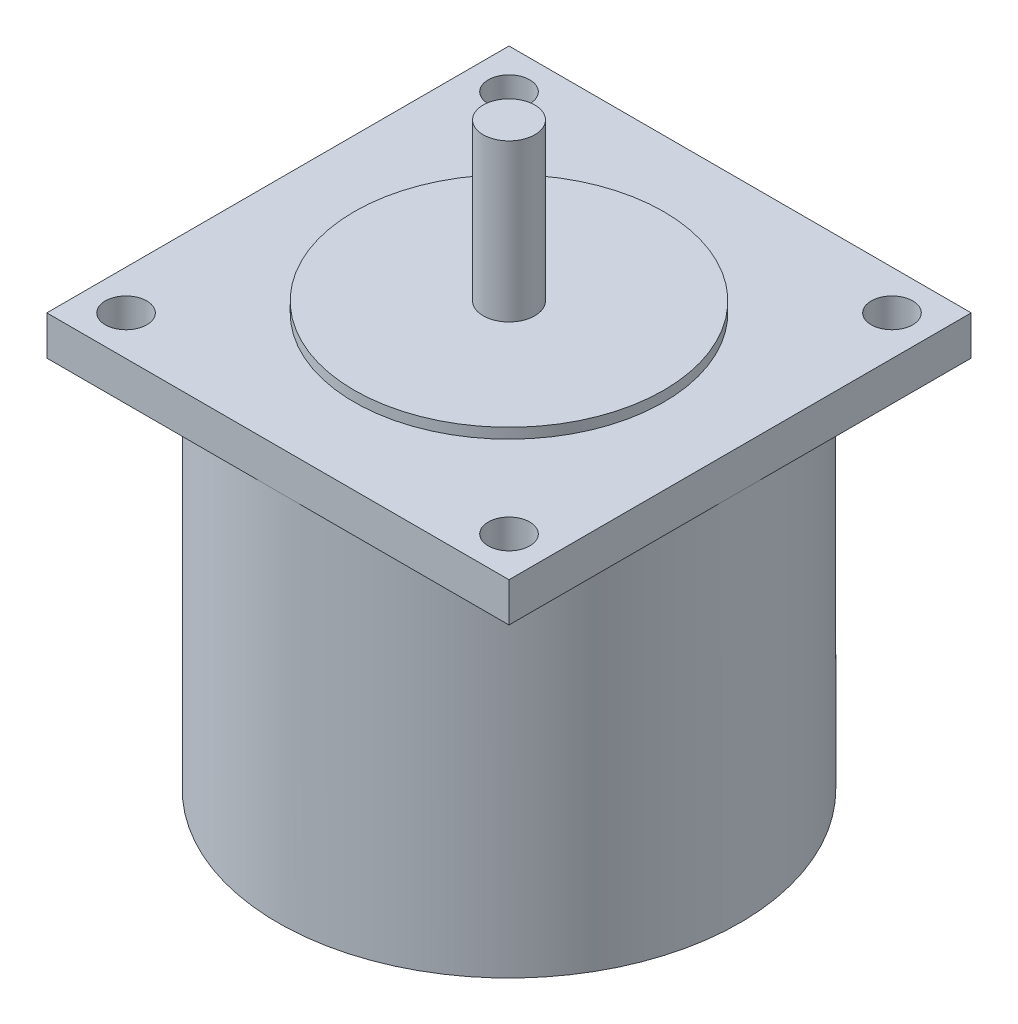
ISO-10303-21;
HEADER;
FILE_DESCRIPTION(('STEP AP214'),'2;1');
FILE_NAME('part.step','',(''),(''),'','','');
FILE_SCHEMA(('AUTOMOTIVE_DESIGN { 1 0 10303 214 1 1 1 1 }'));
ENDSEC;
DATA;
#1=APPLICATION_CONTEXT('core data for automotive mechanical design processes');
#2=APPLICATION_PROTOCOL_DEFINITION('international standard','automotive_design',2000,#1);
#3=PRODUCT_CONTEXT('',#1,'mechanical');
#4=PRODUCT('Part','Part','',(#3));
#5=PRODUCT_RELATED_PRODUCT_CATEGORY('part','',(#4));
#6=PRODUCT_DEFINITION_FORMATION('','',#4);
#7=PRODUCT_DEFINITION_CONTEXT('part definition',#1,'design');
#8=PRODUCT_DEFINITION('design','',#6,#7);
#9=PRODUCT_DEFINITION_SHAPE('','',#8);
#10=(LENGTH_UNIT() NAMED_UNIT(*) SI_UNIT(.MILLI.,.METRE.));
#11=(NAMED_UNIT(*) PLANE_ANGLE_UNIT() SI_UNIT($,.RADIAN.));
#12=(NAMED_UNIT(*) SI_UNIT($,.STERADIAN.) SOLID_ANGLE_UNIT());
#13=UNCERTAINTY_MEASURE_WITH_UNIT(LENGTH_MEASURE(1.E-05),#10,'distance_accuracy_value','');
#14=(GEOMETRIC_REPRESENTATION_CONTEXT(3) GLOBAL_UNCERTAINTY_ASSIGNED_CONTEXT((#13)) GLOBAL_UNIT_ASSIGNED_CONTEXT((#10,
#11,#12)) REPRESENTATION_CONTEXT('',''));
#15=CARTESIAN_POINT('',(0.,0.,0.));
#16=DIRECTION('',(0.,0.,1.));
#17=DIRECTION('',(1.,0.,0.));
#18=AXIS2_PLACEMENT_3D('',#15,#16,#17);
#19=CARTESIAN_POINT('',(0.,0.,-56.896));
#20=DIRECTION('',(0.,-1.,0.));
#21=DIRECTION('',(0.,0.,-1.));
#22=AXIS2_PLACEMENT_3D('',#19,#20,#21);
#23=PLANE('',#22);
#24=DIRECTION('',(0.,0.,1.));
#25=VECTOR('',#24,1.);
#26=CARTESIAN_POINT('',(0.,0.,0.));
#27=LINE('',#26,#25);
#28=CARTESIAN_POINT('',(0.,0.,-56.896));
#29=VERTEX_POINT('',#28);
#30=CARTESIAN_POINT('',(0.,0.,0.));
#31=VERTEX_POINT('',#30);
#32=EDGE_CURVE('E128',#29,#31,#27,.T.);
#33=ORIENTED_EDGE('',*,*,#32,.T.);
#34=DIRECTION('',(1.,0.,0.));
#35=VECTOR('',#34,1.);
#36=CARTESIAN_POINT('',(0.,0.,0.));
#37=LINE('',#36,#35);
#38=CARTESIAN_POINT('',(56.896,0.,0.));
#39=VERTEX_POINT('',#38);
#40=EDGE_CURVE('E138',#31,#39,#37,.T.);
#41=ORIENTED_EDGE('',*,*,#40,.T.);
#42=DIRECTION('',(0.,0.,-1.));
#43=VECTOR('',#42,1.);
#44=CARTESIAN_POINT('',(56.896,0.,0.));
#45=LINE('',#44,#43);
#46=CARTESIAN_POINT('',(56.896,0.,-56.896));
#47=VERTEX_POINT('',#46);
#48=EDGE_CURVE('E141',#39,#47,#45,.T.);
#49=ORIENTED_EDGE('',*,*,#48,.T.);
#50=DIRECTION('',(-1.,0.,0.));
#51=VECTOR('',#50,1.);
#52=CARTESIAN_POINT('',(0.,0.,-56.896));
#53=LINE('',#52,#51);
#54=EDGE_CURVE('E144',#47,#29,#53,.T.);
#55=ORIENTED_EDGE('',*,*,#54,.T.);
#56=EDGE_LOOP('',(#33,#41,#49,#55));
#57=FACE_BOUND('',#56,.T.);
#58=CARTESIAN_POINT('',(4.87680000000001,0.,-52.0192));
#59=DIRECTION('',(0.,-1.,0.));
#60=DIRECTION('',(0.,0.,-1.));
#61=AXIS2_PLACEMENT_3D('',#58,#59,#60);
#62=CIRCLE('',#61,2.5527);
#63=CARTESIAN_POINT('',(4.87680000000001,0.,-54.5719));
#64=VERTEX_POINT('',#63);
#65=EDGE_CURVE('E180',#64,#64,#62,.T.);
#66=ORIENTED_EDGE('',*,*,#65,.T.);
#67=EDGE_LOOP('',(#66));
#68=FACE_BOUND('',#67,.T.);
#69=CARTESIAN_POINT('',(52.0192,0.,-52.0192));
#70=DIRECTION('',(0.,-1.,0.));
#71=DIRECTION('',(0.,0.,-1.));
#72=AXIS2_PLACEMENT_3D('',#69,#70,#71);
#73=CIRCLE('',#72,2.5527);
#74=CARTESIAN_POINT('',(52.0192,0.,-54.5719));
#75=VERTEX_POINT('',#74);
#76=EDGE_CURVE('E175',#75,#75,#73,.T.);
#77=ORIENTED_EDGE('',*,*,#76,.T.);
#78=EDGE_LOOP('',(#77));
#79=FACE_BOUND('',#78,.T.);
#80=CARTESIAN_POINT('',(52.0192,0.,-4.8768));
#81=DIRECTION('',(0.,-1.,0.));
#82=DIRECTION('',(0.,0.,-1.));
#83=AXIS2_PLACEMENT_3D('',#80,#81,#82);
#84=CIRCLE('',#83,2.5527);
#85=CARTESIAN_POINT('',(52.0192,0.,-7.4295));
#86=VERTEX_POINT('',#85);
#87=EDGE_CURVE('E169',#86,#86,#84,.T.);
#88=ORIENTED_EDGE('',*,*,#87,.T.);
#89=EDGE_LOOP('',(#88));
#90=FACE_BOUND('',#89,.T.);
#91=CARTESIAN_POINT('',(4.8768,0.,-4.8768));
#92=DIRECTION('',(0.,-1.,0.));
#93=DIRECTION('',(0.,0.,-1.));
#94=AXIS2_PLACEMENT_3D('',#91,#92,#93);
#95=CIRCLE('',#94,2.5527);
#96=CARTESIAN_POINT('',(4.8768,0.,-7.4295));
#97=VERTEX_POINT('',#96);
#98=EDGE_CURVE('E157',#97,#97,#95,.T.);
#99=ORIENTED_EDGE('',*,*,#98,.T.);
#100=EDGE_LOOP('',(#99));
#101=FACE_BOUND('',#100,.T.);
#102=CARTESIAN_POINT('',(28.448,0.,-28.448));
#103=DIRECTION('',(0.,-1.,0.));
#104=DIRECTION('',(0.,0.,-1.));
#105=AXIS2_PLACEMENT_3D('',#102,#103,#104);
#106=CIRCLE('',#105,19.05);
#107=CARTESIAN_POINT('',(28.448,0.,-47.498));
#108=VERTEX_POINT('',#107);
#109=EDGE_CURVE('E12',#108,#108,#106,.F.);
#110=ORIENTED_EDGE('',*,*,#109,.F.);
#111=EDGE_LOOP('',(#110));
#112=FACE_BOUND('',#111,.T.);
#113=ADVANCED_FACE('F36',(#57,#68,#79,#90,#101,#112),#23,.F.);
#114=CARTESIAN_POINT('',(0.,-4.826,-56.896));
#115=DIRECTION('',(0.,-1.,0.));
#116=DIRECTION('',(0.,0.,-1.));
#117=AXIS2_PLACEMENT_3D('',#114,#115,#116);
#118=PLANE('',#117);
#119=CARTESIAN_POINT('',(52.0192,-4.826,-52.0192));
#120=DIRECTION('',(0.,-1.,0.));
#121=DIRECTION('',(0.,0.,-1.));
#122=AXIS2_PLACEMENT_3D('',#119,#120,#121);
#123=CIRCLE('',#122,2.5527);
#124=CARTESIAN_POINT('',(52.0192,-4.826,-54.5719));
#125=VERTEX_POINT('',#124);
#126=EDGE_CURVE('E172',#125,#125,#123,.T.);
#127=ORIENTED_EDGE('',*,*,#126,.F.);
#128=EDGE_LOOP('',(#127));
#129=FACE_BOUND('',#128,.T.);
#130=CARTESIAN_POINT('',(28.448,-4.826,-28.448));
#131=DIRECTION('',(0.,-1.,0.));
#132=DIRECTION('',(0.,0.,-1.));
#133=AXIS2_PLACEMENT_3D('',#130,#131,#132);
#134=CIRCLE('',#133,28.448);
#135=CARTESIAN_POINT('',(28.448,-4.826,-56.896));
#136=VERTEX_POINT('',#135);
#137=CARTESIAN_POINT('',(56.896,-4.826,-28.448));
#138=VERTEX_POINT('',#137);
#139=EDGE_CURVE('E111',#136,#138,#134,.T.);
#140=ORIENTED_EDGE('',*,*,#139,.F.);
#141=DIRECTION('',(-1.,0.,0.));
#142=VECTOR('',#141,1.);
#143=CARTESIAN_POINT('',(0.,-4.826,-56.896));
#144=LINE('',#143,#142);
#145=CARTESIAN_POINT('',(56.896,-4.826,-56.896));
#146=VERTEX_POINT('',#145);
#147=EDGE_CURVE('E91',#146,#136,#144,.T.);
#148=ORIENTED_EDGE('',*,*,#147,.F.);
#149=DIRECTION('',(0.,0.,-1.));
#150=VECTOR('',#149,1.);
#151=CARTESIAN_POINT('',(56.896,-4.826,0.));
#152=LINE('',#151,#150);
#153=EDGE_CURVE('E113',#138,#146,#152,.T.);
#154=ORIENTED_EDGE('',*,*,#153,.F.);
#155=EDGE_LOOP('',(#140,#148,#154));
#156=FACE_BOUND('',#155,.T.);
#157=ADVANCED_FACE('F112',(#129,#156),#118,.T.);
#158=CARTESIAN_POINT('',(52.0192,-4.826,-4.8768));
#159=DIRECTION('',(0.,-1.,0.));
#160=DIRECTION('',(0.,0.,-1.));
#161=AXIS2_PLACEMENT_3D('',#158,#159,#160);
#162=CIRCLE('',#161,2.5527);
#163=CARTESIAN_POINT('',(52.0192,-4.826,-7.4295));
#164=VERTEX_POINT('',#163);
#165=EDGE_CURVE('E166',#164,#164,#162,.T.);
#166=ORIENTED_EDGE('',*,*,#165,.F.);
#167=EDGE_LOOP('',(#166));
#168=FACE_BOUND('',#167,.T.);
#169=CARTESIAN_POINT('',(28.448,-4.826,0.));
#170=VERTEX_POINT('',#169);
#171=EDGE_CURVE('E44',#138,#170,#134,.T.);
#172=ORIENTED_EDGE('',*,*,#171,.F.);
#173=CARTESIAN_POINT('',(56.896,-4.826,0.));
#174=VERTEX_POINT('',#173);
#175=EDGE_CURVE('E109',#174,#138,#152,.T.);
#176=ORIENTED_EDGE('',*,*,#175,.F.);
#177=DIRECTION('',(1.,0.,0.));
#178=VECTOR('',#177,1.);
#179=CARTESIAN_POINT('',(0.,-4.826,0.));
#180=LINE('',#179,#178);
#181=EDGE_CURVE('E130',#170,#174,#180,.T.);
#182=ORIENTED_EDGE('',*,*,#181,.F.);
#183=EDGE_LOOP('',(#172,#176,#182));
#184=FACE_BOUND('',#183,.T.);
#185=ADVANCED_FACE('F204',(#168,#184),#118,.T.);
#186=CARTESIAN_POINT('',(4.8768,-4.826,-4.8768));
#187=DIRECTION('',(0.,-1.,0.));
#188=DIRECTION('',(0.,0.,-1.));
#189=AXIS2_PLACEMENT_3D('',#186,#187,#188);
#190=CIRCLE('',#189,2.5527);
#191=CARTESIAN_POINT('',(4.8768,-4.826,-7.4295));
#192=VERTEX_POINT('',#191);
#193=EDGE_CURVE('E152',#192,#192,#190,.T.);
#194=ORIENTED_EDGE('',*,*,#193,.F.);
#195=EDGE_LOOP('',(#194));
#196=FACE_BOUND('',#195,.T.);
#197=CARTESIAN_POINT('',(0.,-4.826,-28.448));
#198=VERTEX_POINT('',#197);
#199=EDGE_CURVE('E51',#170,#198,#134,.T.);
#200=ORIENTED_EDGE('',*,*,#199,.F.);
#201=CARTESIAN_POINT('',(0.,-4.826,0.));
#202=VERTEX_POINT('',#201);
#203=EDGE_CURVE('E132',#202,#170,#180,.T.);
#204=ORIENTED_EDGE('',*,*,#203,.F.);
#205=DIRECTION('',(0.,0.,1.));
#206=VECTOR('',#205,1.);
#207=CARTESIAN_POINT('',(0.,-4.826,0.));
#208=LINE('',#207,#206);
#209=EDGE_CURVE('E131',#198,#202,#208,.T.);
#210=ORIENTED_EDGE('',*,*,#209,.F.);
#211=EDGE_LOOP('',(#200,#204,#210));
#212=FACE_BOUND('',#211,.T.);
#213=ADVANCED_FACE('F221',(#196,#212),#118,.T.);
#214=CARTESIAN_POINT('',(0.,-4.826,0.));
#215=DIRECTION('',(-1.,0.,0.));
#216=DIRECTION('',(0.,0.,1.));
#217=AXIS2_PLACEMENT_3D('',#214,#215,#216);
#218=PLANE('',#217);
#219=ORIENTED_EDGE('',*,*,#32,.F.);
#220=DIRECTION('',(0.,1.,0.));
#221=VECTOR('',#220,1.);
#222=CARTESIAN_POINT('',(0.,-4.826,-56.896));
#223=LINE('',#222,#221);
#224=CARTESIAN_POINT('',(0.,-4.826,-56.896));
#225=VERTEX_POINT('',#224);
#226=EDGE_CURVE('E121',#225,#29,#223,.T.);
#227=ORIENTED_EDGE('',*,*,#226,.F.);
#228=EDGE_CURVE('E108',#225,#198,#208,.T.);
#229=ORIENTED_EDGE('',*,*,#228,.T.);
#230=ORIENTED_EDGE('',*,*,#209,.T.);
#231=DIRECTION('',(0.,1.,0.));
#232=VECTOR('',#231,1.);
#233=CARTESIAN_POINT('',(0.,-4.826,0.));
#234=LINE('',#233,#232);
#235=EDGE_CURVE('E100',#202,#31,#234,.T.);
#236=ORIENTED_EDGE('',*,*,#235,.T.);
#237=EDGE_LOOP('',(#219,#227,#229,#230,#236));
#238=FACE_BOUND('',#237,.T.);
#239=ADVANCED_FACE('F38',(#238),#218,.T.);
#240=CARTESIAN_POINT('',(0.,-4.826,-56.896));
#241=DIRECTION('',(0.,0.,-1.));
#242=DIRECTION('',(-1.,0.,0.));
#243=AXIS2_PLACEMENT_3D('',#240,#241,#242);
#244=PLANE('',#243);
#245=ORIENTED_EDGE('',*,*,#54,.F.);
#246=DIRECTION('',(0.,1.,0.));
#247=VECTOR('',#246,1.);
#248=CARTESIAN_POINT('',(56.896,-4.826,-56.896));
#249=LINE('',#248,#247);
#250=EDGE_CURVE('E97',#146,#47,#249,.T.);
#251=ORIENTED_EDGE('',*,*,#250,.F.);
#252=ORIENTED_EDGE('',*,*,#147,.T.);
#253=EDGE_CURVE('E95',#136,#225,#144,.T.);
#254=ORIENTED_EDGE('',*,*,#253,.T.);
#255=ORIENTED_EDGE('',*,*,#226,.T.);
#256=EDGE_LOOP('',(#245,#251,#252,#254,#255));
#257=FACE_BOUND('',#256,.T.);
#258=ADVANCED_FACE('F94',(#257),#244,.T.);
#259=CARTESIAN_POINT('',(56.896,-4.826,0.));
#260=DIRECTION('',(1.,0.,0.));
#261=DIRECTION('',(0.,0.,-1.));
#262=AXIS2_PLACEMENT_3D('',#259,#260,#261);
#263=PLANE('',#262);
#264=ORIENTED_EDGE('',*,*,#48,.F.);
#265=DIRECTION('',(0.,1.,0.));
#266=VECTOR('',#265,1.);
#267=CARTESIAN_POINT('',(56.896,-4.826,0.));
#268=LINE('',#267,#266);
#269=EDGE_CURVE('E148',#174,#39,#268,.T.);
#270=ORIENTED_EDGE('',*,*,#269,.F.);
#271=ORIENTED_EDGE('',*,*,#175,.T.);
#272=ORIENTED_EDGE('',*,*,#153,.T.);
#273=ORIENTED_EDGE('',*,*,#250,.T.);
#274=EDGE_LOOP('',(#264,#270,#271,#272,#273));
#275=FACE_BOUND('',#274,.T.);
#276=ADVANCED_FACE('F211',(#275),#263,.T.);
#277=CARTESIAN_POINT('',(0.,-4.826,0.));
#278=DIRECTION('',(0.,0.,1.));
#279=DIRECTION('',(1.,0.,0.));
#280=AXIS2_PLACEMENT_3D('',#277,#278,#279);
#281=PLANE('',#280);
#282=ORIENTED_EDGE('',*,*,#40,.F.);
#283=ORIENTED_EDGE('',*,*,#235,.F.);
#284=ORIENTED_EDGE('',*,*,#203,.T.);
#285=ORIENTED_EDGE('',*,*,#181,.T.);
#286=ORIENTED_EDGE('',*,*,#269,.T.);
#287=EDGE_LOOP('',(#282,#283,#284,#285,#286));
#288=FACE_BOUND('',#287,.T.);
#289=ADVANCED_FACE('F213',(#288),#281,.T.);
#290=CARTESIAN_POINT('',(4.87680000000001,-4.826,-52.0192));
#291=DIRECTION('',(0.,-1.,0.));
#292=DIRECTION('',(0.,0.,-1.));
#293=AXIS2_PLACEMENT_3D('',#290,#291,#292);
#294=CIRCLE('',#293,2.5527);
#295=CARTESIAN_POINT('',(4.87680000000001,-4.826,-54.5719));
#296=VERTEX_POINT('',#295);
#297=EDGE_CURVE('E178',#296,#296,#294,.T.);
#298=ORIENTED_EDGE('',*,*,#297,.F.);
#299=EDGE_LOOP('',(#298));
#300=FACE_BOUND('',#299,.T.);
#301=EDGE_CURVE('E106',#198,#136,#134,.T.);
#302=ORIENTED_EDGE('',*,*,#301,.F.);
#303=ORIENTED_EDGE('',*,*,#228,.F.);
#304=ORIENTED_EDGE('',*,*,#253,.F.);
#305=EDGE_LOOP('',(#302,#303,#304));
#306=FACE_BOUND('',#305,.T.);
#307=ADVANCED_FACE('F104',(#300,#306),#118,.T.);
#308=CARTESIAN_POINT('',(28.448,-182.06309484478,-28.448));
#309=DIRECTION('',(0.,1.,0.));
#310=DIRECTION('',(0.,0.,1.));
#311=AXIS2_PLACEMENT_3D('',#308,#309,#310);
#312=CYLINDRICAL_SURFACE('',#311,28.448);
#313=ORIENTED_EDGE('',*,*,#139,.T.);
#314=ORIENTED_EDGE('',*,*,#171,.T.);
#315=ORIENTED_EDGE('',*,*,#199,.T.);
#316=ORIENTED_EDGE('',*,*,#301,.T.);
#317=EDGE_LOOP('',(#313,#314,#315,#316));
#318=FACE_BOUND('',#317,.T.);
#319=CARTESIAN_POINT('',(28.448,-50.8,-28.448));
#320=DIRECTION('',(0.,-1.,0.));
#321=DIRECTION('',(0.,0.,-1.));
#322=AXIS2_PLACEMENT_3D('',#319,#320,#321);
#323=CIRCLE('',#322,28.448);
#324=CARTESIAN_POINT('',(28.448,-50.8,-56.896));
#325=VERTEX_POINT('',#324);
#326=EDGE_CURVE('E116',#325,#325,#323,.T.);
#327=ORIENTED_EDGE('',*,*,#326,.F.);
#328=EDGE_LOOP('',(#327));
#329=FACE_BOUND('',#328,.T.);
#330=ADVANCED_FACE('F119',(#318,#329),#312,.T.);
#331=CARTESIAN_POINT('',(0.,-50.8,-56.896));
#332=DIRECTION('',(0.,-1.,0.));
#333=DIRECTION('',(0.,0.,-1.));
#334=AXIS2_PLACEMENT_3D('',#331,#332,#333);
#335=PLANE('',#334);
#336=ORIENTED_EDGE('',*,*,#326,.T.);
#337=EDGE_LOOP('',(#336));
#338=FACE_BOUND('',#337,.T.);
#339=ADVANCED_FACE('F266',(#338),#335,.T.);
#340=CARTESIAN_POINT('',(4.87680000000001,-4.826,-52.0192));
#341=DIRECTION('',(0.,-1.,0.));
#342=DIRECTION('',(0.,0.,-1.));
#343=AXIS2_PLACEMENT_3D('',#340,#341,#342);
#344=CYLINDRICAL_SURFACE('',#343,2.5527);
#345=ORIENTED_EDGE('',*,*,#297,.T.);
#346=EDGE_LOOP('',(#345));
#347=FACE_BOUND('',#346,.T.);
#348=ORIENTED_EDGE('',*,*,#65,.F.);
#349=EDGE_LOOP('',(#348));
#350=FACE_BOUND('',#349,.T.);
#351=ADVANCED_FACE('F263',(#347,#350),#344,.F.);
#352=CARTESIAN_POINT('',(52.0192,-4.826,-52.0192));
#353=DIRECTION('',(0.,-1.,0.));
#354=DIRECTION('',(0.,0.,-1.));
#355=AXIS2_PLACEMENT_3D('',#352,#353,#354);
#356=CYLINDRICAL_SURFACE('',#355,2.5527);
#357=ORIENTED_EDGE('',*,*,#126,.T.);
#358=EDGE_LOOP('',(#357));
#359=FACE_BOUND('',#358,.T.);
#360=ORIENTED_EDGE('',*,*,#76,.F.);
#361=EDGE_LOOP('',(#360));
#362=FACE_BOUND('',#361,.T.);
#363=ADVANCED_FACE('F240',(#359,#362),#356,.F.);
#364=CARTESIAN_POINT('',(52.0192,-4.826,-4.8768));
#365=DIRECTION('',(0.,-1.,0.));
#366=DIRECTION('',(0.,0.,-1.));
#367=AXIS2_PLACEMENT_3D('',#364,#365,#366);
#368=CYLINDRICAL_SURFACE('',#367,2.5527);
#369=ORIENTED_EDGE('',*,*,#165,.T.);
#370=EDGE_LOOP('',(#369));
#371=FACE_BOUND('',#370,.T.);
#372=ORIENTED_EDGE('',*,*,#87,.F.);
#373=EDGE_LOOP('',(#372));
#374=FACE_BOUND('',#373,.T.);
#375=ADVANCED_FACE('F236',(#371,#374),#368,.F.);
#376=CARTESIAN_POINT('',(4.8768,-4.826,-4.8768));
#377=DIRECTION('',(0.,-1.,0.));
#378=DIRECTION('',(0.,0.,-1.));
#379=AXIS2_PLACEMENT_3D('',#376,#377,#378);
#380=CYLINDRICAL_SURFACE('',#379,2.5527);
#381=ORIENTED_EDGE('',*,*,#193,.T.);
#382=EDGE_LOOP('',(#381));
#383=FACE_BOUND('',#382,.T.);
#384=ORIENTED_EDGE('',*,*,#98,.F.);
#385=EDGE_LOOP('',(#384));
#386=FACE_BOUND('',#385,.T.);
#387=ADVANCED_FACE('F239',(#383,#386),#380,.F.);
#388=CARTESIAN_POINT('',(28.448,1.27,-28.448));
#389=DIRECTION('',(0.,1.,0.));
#390=DIRECTION('',(0.,0.,1.));
#391=AXIS2_PLACEMENT_3D('',#388,#389,#390);
#392=PLANE('',#391);
#393=CARTESIAN_POINT('',(28.448,1.27,-28.448));
#394=DIRECTION('',(0.,1.,0.));
#395=DIRECTION('',(0.,0.,1.));
#396=AXIS2_PLACEMENT_3D('',#393,#394,#395);
#397=CIRCLE('',#396,19.05);
#398=CARTESIAN_POINT('',(28.448,1.27,-9.398));
#399=VERTEX_POINT('',#398);
#400=EDGE_CURVE('E153',#399,#399,#397,.T.);
#401=ORIENTED_EDGE('',*,*,#400,.T.);
#402=EDGE_LOOP('',(#401));
#403=FACE_BOUND('',#402,.T.);
#404=CARTESIAN_POINT('',(28.448,1.27,-28.448));
#405=DIRECTION('',(0.,1.,0.));
#406=DIRECTION('',(0.,0.,1.));
#407=AXIS2_PLACEMENT_3D('',#404,#405,#406);
#408=CIRCLE('',#407,3.175);
#409=CARTESIAN_POINT('',(28.448,1.27,-25.273));
#410=VERTEX_POINT('',#409);
#411=EDGE_CURVE('E150',#410,#410,#408,.T.);
#412=ORIENTED_EDGE('',*,*,#411,.F.);
#413=EDGE_LOOP('',(#412));
#414=FACE_BOUND('',#413,.T.);
#415=ADVANCED_FACE('F250',(#403,#414),#392,.T.);
#416=CARTESIAN_POINT('',(28.448,1.27,-28.448));
#417=DIRECTION('',(0.,-1.,0.));
#418=DIRECTION('',(0.,0.,-1.));
#419=AXIS2_PLACEMENT_3D('',#416,#417,#418);
#420=CYLINDRICAL_SURFACE('',#419,19.05);
#421=ORIENTED_EDGE('',*,*,#400,.F.);
#422=EDGE_LOOP('',(#421));
#423=FACE_BOUND('',#422,.T.);
#424=ORIENTED_EDGE('',*,*,#109,.T.);
#425=EDGE_LOOP('',(#424));
#426=FACE_BOUND('',#425,.T.);
#427=ADVANCED_FACE('F195',(#423,#426),#420,.T.);
#428=CARTESIAN_POINT('',(28.448,20.574,-28.448));
#429=DIRECTION('',(0.,1.,0.));
#430=DIRECTION('',(0.,0.,1.));
#431=AXIS2_PLACEMENT_3D('',#428,#429,#430);
#432=PLANE('',#431);
#433=CARTESIAN_POINT('',(28.448,20.574,-28.448));
#434=DIRECTION('',(0.,1.,0.));
#435=DIRECTION('',(0.,0.,1.));
#436=AXIS2_PLACEMENT_3D('',#433,#434,#435);
#437=CIRCLE('',#436,3.175);
#438=CARTESIAN_POINT('',(28.448,20.574,-25.273));
#439=VERTEX_POINT('',#438);
#440=EDGE_CURVE('E117',#439,#439,#437,.T.);
#441=ORIENTED_EDGE('',*,*,#440,.T.);
#442=EDGE_LOOP('',(#441));
#443=FACE_BOUND('',#442,.T.);
#444=ADVANCED_FACE('F187',(#443),#432,.T.);
#445=CARTESIAN_POINT('',(28.448,20.574,-28.448));
#446=DIRECTION('',(0.,-1.,0.));
#447=DIRECTION('',(0.,0.,-1.));
#448=AXIS2_PLACEMENT_3D('',#445,#446,#447);
#449=CYLINDRICAL_SURFACE('',#448,3.175);
#450=ORIENTED_EDGE('',*,*,#411,.T.);
#451=EDGE_LOOP('',(#450));
#452=FACE_BOUND('',#451,.T.);
#453=ORIENTED_EDGE('',*,*,#440,.F.);
#454=EDGE_LOOP('',(#453));
#455=FACE_BOUND('',#454,.T.);
#456=ADVANCED_FACE('F189',(#452,#455),#449,.T.);
#457=CLOSED_SHELL('',(#113,#157,#185,#213,#239,#258,#276,#289,#307,#330,#339,#351,#363,#375,
#387,#415,#427,#444,#456));
#458=MANIFOLD_SOLID_BREP('B2',#457);
#459=ADVANCED_BREP_SHAPE_REPRESENTATION('',(#18,#458),#14);
#460=SHAPE_DEFINITION_REPRESENTATION(#9,#459);
ENDSEC;
END-ISO-10303-21;
